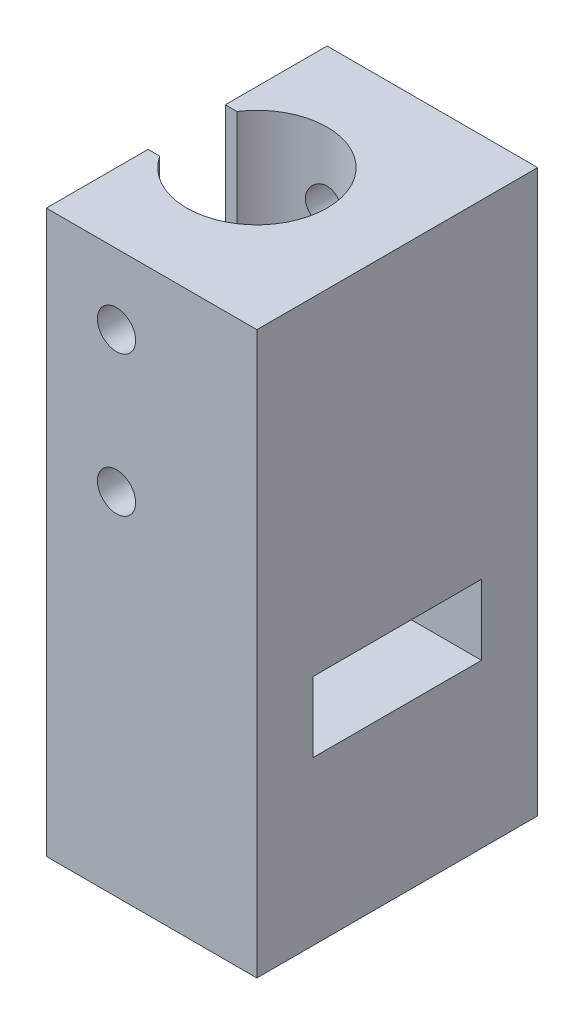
ISO-10303-21;
HEADER;
FILE_DESCRIPTION(('STEP AP214'),'2;1');
FILE_NAME('part.step','',(''),(''),'','','');
FILE_SCHEMA(('AUTOMOTIVE_DESIGN { 1 0 10303 214 1 1 1 1 }'));
ENDSEC;
DATA;
#1=APPLICATION_CONTEXT('core data for automotive mechanical design processes');
#2=APPLICATION_PROTOCOL_DEFINITION('international standard','automotive_design',2000,#1);
#3=PRODUCT_CONTEXT('',#1,'mechanical');
#4=PRODUCT('Part','Part','',(#3));
#5=PRODUCT_RELATED_PRODUCT_CATEGORY('part','',(#4));
#6=PRODUCT_DEFINITION_FORMATION('','',#4);
#7=PRODUCT_DEFINITION_CONTEXT('part definition',#1,'design');
#8=PRODUCT_DEFINITION('design','',#6,#7);
#9=PRODUCT_DEFINITION_SHAPE('','',#8);
#10=(LENGTH_UNIT() NAMED_UNIT(*) SI_UNIT(.MILLI.,.METRE.));
#11=(NAMED_UNIT(*) PLANE_ANGLE_UNIT() SI_UNIT($,.RADIAN.));
#12=(NAMED_UNIT(*) SI_UNIT($,.STERADIAN.) SOLID_ANGLE_UNIT());
#13=UNCERTAINTY_MEASURE_WITH_UNIT(LENGTH_MEASURE(1.E-05),#10,'distance_accuracy_value','');
#14=(GEOMETRIC_REPRESENTATION_CONTEXT(3) GLOBAL_UNCERTAINTY_ASSIGNED_CONTEXT((#13)) GLOBAL_UNIT_ASSIGNED_CONTEXT((#10,
#11,#12)) REPRESENTATION_CONTEXT('',''));
#15=CARTESIAN_POINT('',(0.,0.,0.));
#16=DIRECTION('',(0.,0.,1.));
#17=DIRECTION('',(1.,0.,0.));
#18=AXIS2_PLACEMENT_3D('',#15,#16,#17);
#19=CARTESIAN_POINT('',(-26.6053608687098,6.35,-9.48462085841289));
#20=DIRECTION('',(0.,1.,0.));
#21=DIRECTION('',(0.,0.,1.));
#22=AXIS2_PLACEMENT_3D('',#19,#20,#21);
#23=CYLINDRICAL_SURFACE('',#22,4.44499999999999);
#24=CARTESIAN_POINT('',(-26.6053608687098,14.732,-9.48462085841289));
#25=DIRECTION('',(0.,-1.,0.));
#26=DIRECTION('',(0.,0.,-1.));
#27=AXIS2_PLACEMENT_3D('',#24,#25,#26);
#28=CIRCLE('',#27,4.44499999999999);
#29=CARTESIAN_POINT('',(-26.6053608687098,14.732,-13.9296208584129));
#30=VERTEX_POINT('',#29);
#31=EDGE_CURVE('E237',#30,#30,#28,.F.);
#32=ORIENTED_EDGE('',*,*,#31,.T.);
#33=EDGE_LOOP('',(#32));
#34=FACE_BOUND('',#33,.T.);
#35=DIRECTION('',(0.,1.,0.));
#36=VECTOR('',#35,1.);
#37=CARTESIAN_POINT('',(-26.6053608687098,7.9502,-5.03962085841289));
#38=LINE('',#37,#36);
#39=CARTESIAN_POINT('',(-26.6053608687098,6.35,-5.03962085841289));
#40=VERTEX_POINT('',#39);
#41=CARTESIAN_POINT('',(-26.6053608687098,7.9502,-5.03962085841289));
#42=VERTEX_POINT('',#41);
#43=EDGE_CURVE('E251',#40,#42,#38,.T.);
#44=ORIENTED_EDGE('',*,*,#43,.T.);
#45=CARTESIAN_POINT('',(-26.6053608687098,7.9502,-9.48462085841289));
#46=DIRECTION('',(0.,1.,0.));
#47=DIRECTION('',(0.,0.,1.));
#48=AXIS2_PLACEMENT_3D('',#45,#46,#47);
#49=CIRCLE('',#48,4.44499999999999);
#50=CARTESIAN_POINT('',(-26.6053608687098,7.9502,-13.9296208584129));
#51=VERTEX_POINT('',#50);
#52=EDGE_CURVE('E52',#42,#51,#49,.F.);
#53=ORIENTED_EDGE('',*,*,#52,.T.);
#54=DIRECTION('',(0.,-1.,0.));
#55=VECTOR('',#54,1.);
#56=CARTESIAN_POINT('',(-26.6053608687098,7.9502,-13.9296208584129));
#57=LINE('',#56,#55);
#58=CARTESIAN_POINT('',(-26.6053608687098,6.35,-13.9296208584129));
#59=VERTEX_POINT('',#58);
#60=EDGE_CURVE('E248',#51,#59,#57,.T.);
#61=ORIENTED_EDGE('',*,*,#60,.T.);
#62=CARTESIAN_POINT('',(-26.6053608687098,6.35,-9.48462085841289));
#63=DIRECTION('',(0.,1.,0.));
#64=DIRECTION('',(0.,0.,1.));
#65=AXIS2_PLACEMENT_3D('',#62,#63,#64);
#66=CIRCLE('',#65,4.44499999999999);
#67=EDGE_CURVE('E204',#40,#59,#66,.T.);
#68=ORIENTED_EDGE('',*,*,#67,.F.);
#69=EDGE_LOOP('',(#44,#53,#61,#68));
#70=FACE_BOUND('',#69,.T.);
#71=ADVANCED_FACE('F43',(#34,#70),#23,.F.);
#72=CARTESIAN_POINT('',(-39.3053608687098,50.8,-22.1846208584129));
#73=DIRECTION('',(0.,0.,1.));
#74=DIRECTION('',(1.,0.,0.));
#75=AXIS2_PLACEMENT_3D('',#72,#73,#74);
#76=PLANE('',#75);
#77=CARTESIAN_POINT('',(-26.6053608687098,44.45,-22.1846208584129));
#78=DIRECTION('',(0.,0.,-1.));
#79=DIRECTION('',(-1.,0.,0.));
#80=AXIS2_PLACEMENT_3D('',#77,#78,#79);
#81=CIRCLE('',#80,1.72719999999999);
#82=CARTESIAN_POINT('',(-28.3325608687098,44.45,-22.1846208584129));
#83=VERTEX_POINT('',#82);
#84=EDGE_CURVE('E435',#83,#83,#81,.T.);
#85=ORIENTED_EDGE('',*,*,#84,.F.);
#86=EDGE_LOOP('',(#85));
#87=FACE_BOUND('',#86,.T.);
#88=DIRECTION('',(-1.,0.,0.));
#89=VECTOR('',#88,1.);
#90=CARTESIAN_POINT('',(-39.3053608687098,0.,-22.1846208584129));
#91=LINE('',#90,#89);
#92=CARTESIAN_POINT('',(-13.9053608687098,0.,-22.1846208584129));
#93=VERTEX_POINT('',#92);
#94=CARTESIAN_POINT('',(-32.9553608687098,0.,-22.1846208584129));
#95=VERTEX_POINT('',#94);
#96=EDGE_CURVE('E194',#93,#95,#91,.T.);
#97=ORIENTED_EDGE('',*,*,#96,.T.);
#98=DIRECTION('',(0.,-1.,0.));
#99=VECTOR('',#98,1.);
#100=CARTESIAN_POINT('',(-32.9553608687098,50.8,-22.1846208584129));
#101=LINE('',#100,#99);
#102=CARTESIAN_POINT('',(-32.9553608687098,50.8,-22.1846208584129));
#103=VERTEX_POINT('',#102);
#104=EDGE_CURVE('E177',#103,#95,#101,.T.);
#105=ORIENTED_EDGE('',*,*,#104,.F.);
#106=DIRECTION('',(-1.,0.,0.));
#107=VECTOR('',#106,1.);
#108=CARTESIAN_POINT('',(-39.3053608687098,50.8,-22.1846208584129));
#109=LINE('',#108,#107);
#110=CARTESIAN_POINT('',(-13.9053608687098,50.8,-22.1846208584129));
#111=VERTEX_POINT('',#110);
#112=EDGE_CURVE('E198',#111,#103,#109,.T.);
#113=ORIENTED_EDGE('',*,*,#112,.F.);
#114=DIRECTION('',(0.,-1.,0.));
#115=VECTOR('',#114,1.);
#116=CARTESIAN_POINT('',(-13.9053608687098,50.8,-22.1846208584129));
#117=LINE('',#116,#115);
#118=EDGE_CURVE('E210',#111,#93,#117,.T.);
#119=ORIENTED_EDGE('',*,*,#118,.T.);
#120=EDGE_LOOP('',(#97,#105,#113,#119));
#121=FACE_BOUND('',#120,.T.);
#122=CARTESIAN_POINT('',(-26.6053608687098,31.75,-22.1846208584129));
#123=DIRECTION('',(0.,0.,-1.));
#124=DIRECTION('',(-1.,0.,0.));
#125=AXIS2_PLACEMENT_3D('',#122,#123,#124);
#126=CIRCLE('',#125,1.72719999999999);
#127=CARTESIAN_POINT('',(-28.3325608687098,31.75,-22.1846208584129));
#128=VERTEX_POINT('',#127);
#129=EDGE_CURVE('E413',#128,#128,#126,.T.);
#130=ORIENTED_EDGE('',*,*,#129,.F.);
#131=EDGE_LOOP('',(#130));
#132=FACE_BOUND('',#131,.T.);
#133=ADVANCED_FACE('F304',(#87,#121,#132),#76,.F.);
#134=DIRECTION('',(0.,1.,0.));
#135=VECTOR('',#134,1.);
#136=CARTESIAN_POINT('',(-29.3549915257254,6.35,-12.9771208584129));
#137=LINE('',#136,#135);
#138=CARTESIAN_POINT('',(-29.3549915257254,25.4,-12.9771208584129));
#139=VERTEX_POINT('',#138);
#140=CARTESIAN_POINT('',(-29.3549915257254,21.082,-12.9771208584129));
#141=VERTEX_POINT('',#140);
#142=EDGE_CURVE('E229',#139,#141,#137,.F.);
#143=ORIENTED_EDGE('',*,*,#142,.T.);
#144=CARTESIAN_POINT('',(-26.6053608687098,21.082,-9.48462085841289));
#145=DIRECTION('',(0.,1.,0.));
#146=DIRECTION('',(0.,0.,1.));
#147=AXIS2_PLACEMENT_3D('',#144,#145,#146);
#148=CIRCLE('',#147,4.44499999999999);
#149=CARTESIAN_POINT('',(-29.3549915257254,21.082,-5.99212085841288));
#150=VERTEX_POINT('',#149);
#151=EDGE_CURVE('E325',#141,#150,#148,.F.);
#152=ORIENTED_EDGE('',*,*,#151,.T.);
#153=DIRECTION('',(0.,1.,0.));
#154=VECTOR('',#153,1.);
#155=CARTESIAN_POINT('',(-29.3549915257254,6.35,-5.99212085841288));
#156=LINE('',#155,#154);
#157=CARTESIAN_POINT('',(-29.3549915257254,25.4,-5.99212085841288));
#158=VERTEX_POINT('',#157);
#159=EDGE_CURVE('E221',#150,#158,#156,.T.);
#160=ORIENTED_EDGE('',*,*,#159,.T.);
#161=CARTESIAN_POINT('',(-26.6053608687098,25.4,-9.48462085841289));
#162=DIRECTION('',(0.,1.,0.));
#163=DIRECTION('',(0.,0.,1.));
#164=AXIS2_PLACEMENT_3D('',#161,#162,#163);
#165=CIRCLE('',#164,4.44499999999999);
#166=EDGE_CURVE('E222',#139,#158,#165,.F.);
#167=ORIENTED_EDGE('',*,*,#166,.F.);
#168=EDGE_LOOP('',(#143,#152,#160,#167));
#169=FACE_BOUND('',#168,.T.);
#170=ADVANCED_FACE('F307',(#169),#23,.F.);
#171=CARTESIAN_POINT('',(-39.3053608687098,50.8,3.21537914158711));
#172=DIRECTION('',(0.,0.,-1.));
#173=DIRECTION('',(-1.,0.,0.));
#174=AXIS2_PLACEMENT_3D('',#171,#172,#173);
#175=PLANE('',#174);
#176=CARTESIAN_POINT('',(-26.6053608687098,44.45,3.21537914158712));
#177=DIRECTION('',(0.,0.,1.));
#178=DIRECTION('',(1.,0.,0.));
#179=AXIS2_PLACEMENT_3D('',#176,#177,#178);
#180=CIRCLE('',#179,1.72719999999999);
#181=CARTESIAN_POINT('',(-24.8781608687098,44.45,3.21537914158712));
#182=VERTEX_POINT('',#181);
#183=EDGE_CURVE('E267',#182,#182,#180,.T.);
#184=ORIENTED_EDGE('',*,*,#183,.F.);
#185=EDGE_LOOP('',(#184));
#186=FACE_BOUND('',#185,.T.);
#187=CARTESIAN_POINT('',(-26.6053608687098,31.75,3.21537914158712));
#188=DIRECTION('',(0.,0.,1.));
#189=DIRECTION('',(1.,0.,0.));
#190=AXIS2_PLACEMENT_3D('',#187,#188,#189);
#191=CIRCLE('',#190,1.72719999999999);
#192=CARTESIAN_POINT('',(-24.8781608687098,31.75,3.21537914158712));
#193=VERTEX_POINT('',#192);
#194=EDGE_CURVE('E285',#193,#193,#191,.T.);
#195=ORIENTED_EDGE('',*,*,#194,.F.);
#196=EDGE_LOOP('',(#195));
#197=FACE_BOUND('',#196,.T.);
#198=DIRECTION('',(1.,0.,0.));
#199=VECTOR('',#198,1.);
#200=CARTESIAN_POINT('',(-39.3053608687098,50.8,3.21537914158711));
#201=LINE('',#200,#199);
#202=CARTESIAN_POINT('',(-32.9553608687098,50.8,3.21537914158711));
#203=VERTEX_POINT('',#202);
#204=CARTESIAN_POINT('',(-13.9053608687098,50.8,3.21537914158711));
#205=VERTEX_POINT('',#204);
#206=EDGE_CURVE('E182',#203,#205,#201,.T.);
#207=ORIENTED_EDGE('',*,*,#206,.F.);
#208=DIRECTION('',(0.,-1.,0.));
#209=VECTOR('',#208,1.);
#210=CARTESIAN_POINT('',(-32.9553608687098,50.8,3.21537914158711));
#211=LINE('',#210,#209);
#212=CARTESIAN_POINT('',(-32.9553608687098,0.,3.21537914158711));
#213=VERTEX_POINT('',#212);
#214=EDGE_CURVE('E166',#203,#213,#211,.T.);
#215=ORIENTED_EDGE('',*,*,#214,.T.);
#216=DIRECTION('',(1.,0.,0.));
#217=VECTOR('',#216,1.);
#218=CARTESIAN_POINT('',(-39.3053608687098,0.,3.21537914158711));
#219=LINE('',#218,#217);
#220=CARTESIAN_POINT('',(-13.9053608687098,0.,3.21537914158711));
#221=VERTEX_POINT('',#220);
#222=EDGE_CURVE('E211',#213,#221,#219,.T.);
#223=ORIENTED_EDGE('',*,*,#222,.T.);
#224=DIRECTION('',(0.,-1.,0.));
#225=VECTOR('',#224,1.);
#226=CARTESIAN_POINT('',(-13.9053608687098,50.8,3.21537914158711));
#227=LINE('',#226,#225);
#228=EDGE_CURVE('E190',#205,#221,#227,.T.);
#229=ORIENTED_EDGE('',*,*,#228,.F.);
#230=EDGE_LOOP('',(#207,#215,#223,#229));
#231=FACE_BOUND('',#230,.T.);
#232=ADVANCED_FACE('F45',(#186,#197,#231),#175,.F.);
#233=CARTESIAN_POINT('',(-13.9053608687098,50.8,-22.1846208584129));
#234=DIRECTION('',(-1.,0.,0.));
#235=DIRECTION('',(0.,0.,1.));
#236=AXIS2_PLACEMENT_3D('',#233,#234,#235);
#237=PLANE('',#236);
#238=DIRECTION('',(0.,0.,-1.));
#239=VECTOR('',#238,1.);
#240=CARTESIAN_POINT('',(-13.9053608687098,21.082,-17.1046208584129));
#241=LINE('',#240,#239);
#242=CARTESIAN_POINT('',(-13.9053608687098,21.082,-1.86462085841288));
#243=VERTEX_POINT('',#242);
#244=CARTESIAN_POINT('',(-13.9053608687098,21.082,-17.1046208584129));
#245=VERTEX_POINT('',#244);
#246=EDGE_CURVE('E378',#243,#245,#241,.T.);
#247=ORIENTED_EDGE('',*,*,#246,.T.);
#248=DIRECTION('',(0.,-1.,0.));
#249=VECTOR('',#248,1.);
#250=CARTESIAN_POINT('',(-13.9053608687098,21.082,-17.1046208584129));
#251=LINE('',#250,#249);
#252=CARTESIAN_POINT('',(-13.9053608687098,14.732,-17.1046208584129));
#253=VERTEX_POINT('',#252);
#254=EDGE_CURVE('E400',#245,#253,#251,.T.);
#255=ORIENTED_EDGE('',*,*,#254,.T.);
#256=DIRECTION('',(0.,0.,1.));
#257=VECTOR('',#256,1.);
#258=CARTESIAN_POINT('',(-13.9053608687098,14.732,-17.1046208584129));
#259=LINE('',#258,#257);
#260=CARTESIAN_POINT('',(-13.9053608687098,14.732,-1.86462085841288));
#261=VERTEX_POINT('',#260);
#262=EDGE_CURVE('E396',#253,#261,#259,.T.);
#263=ORIENTED_EDGE('',*,*,#262,.T.);
#264=DIRECTION('',(0.,1.,0.));
#265=VECTOR('',#264,1.);
#266=CARTESIAN_POINT('',(-13.9053608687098,21.082,-1.86462085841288));
#267=LINE('',#266,#265);
#268=EDGE_CURVE('E392',#261,#243,#267,.T.);
#269=ORIENTED_EDGE('',*,*,#268,.T.);
#270=EDGE_LOOP('',(#247,#255,#263,#269));
#271=FACE_BOUND('',#270,.T.);
#272=DIRECTION('',(0.,0.,-1.));
#273=VECTOR('',#272,1.);
#274=CARTESIAN_POINT('',(-13.9053608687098,0.,-22.1846208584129));
#275=LINE('',#274,#273);
#276=EDGE_CURVE('E201',#221,#93,#275,.T.);
#277=ORIENTED_EDGE('',*,*,#276,.T.);
#278=ORIENTED_EDGE('',*,*,#118,.F.);
#279=DIRECTION('',(0.,0.,-1.));
#280=VECTOR('',#279,1.);
#281=CARTESIAN_POINT('',(-13.9053608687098,50.8,-22.1846208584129));
#282=LINE('',#281,#280);
#283=EDGE_CURVE('E193',#205,#111,#282,.T.);
#284=ORIENTED_EDGE('',*,*,#283,.F.);
#285=ORIENTED_EDGE('',*,*,#228,.T.);
#286=EDGE_LOOP('',(#277,#278,#284,#285));
#287=FACE_BOUND('',#286,.T.);
#288=ADVANCED_FACE('F320',(#271,#287),#237,.F.);
#289=CARTESIAN_POINT('',(0.,50.8,0.));
#290=DIRECTION('',(0.,1.,0.));
#291=DIRECTION('',(0.,0.,1.));
#292=AXIS2_PLACEMENT_3D('',#289,#290,#291);
#293=PLANE('',#292);
#294=DIRECTION('',(0.,0.,1.));
#295=VECTOR('',#294,1.);
#296=CARTESIAN_POINT('',(-32.9553608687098,50.8,-22.1846208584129));
#297=LINE('',#296,#295);
#298=CARTESIAN_POINT('',(-32.9553608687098,50.8,-5.99212085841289));
#299=VERTEX_POINT('',#298);
#300=EDGE_CURVE('E169',#299,#203,#297,.T.);
#301=ORIENTED_EDGE('',*,*,#300,.T.);
#302=ORIENTED_EDGE('',*,*,#206,.T.);
#303=ORIENTED_EDGE('',*,*,#283,.T.);
#304=ORIENTED_EDGE('',*,*,#112,.T.);
#305=CARTESIAN_POINT('',(-32.9553608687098,50.8,-12.9771208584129));
#306=VERTEX_POINT('',#305);
#307=EDGE_CURVE('E187',#103,#306,#297,.T.);
#308=ORIENTED_EDGE('',*,*,#307,.T.);
#309=DIRECTION('',(-1.,0.,0.));
#310=VECTOR('',#309,1.);
#311=CARTESIAN_POINT('',(-26.6053608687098,50.8,-12.9771208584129));
#312=LINE('',#311,#310);
#313=CARTESIAN_POINT('',(-31.9086564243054,50.8,-12.9771208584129));
#314=VERTEX_POINT('',#313);
#315=EDGE_CURVE('E360',#314,#306,#312,.T.);
#316=ORIENTED_EDGE('',*,*,#315,.F.);
#317=CARTESIAN_POINT('',(-26.6053608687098,50.8,-9.48462085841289));
#318=DIRECTION('',(0.,1.,0.));
#319=DIRECTION('',(0.,0.,1.));
#320=AXIS2_PLACEMENT_3D('',#317,#318,#319);
#321=CIRCLE('',#320,6.35);
#322=CARTESIAN_POINT('',(-31.9086564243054,50.8,-5.99212085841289));
#323=VERTEX_POINT('',#322);
#324=EDGE_CURVE('E346',#323,#314,#321,.T.);
#325=ORIENTED_EDGE('',*,*,#324,.F.);
#326=DIRECTION('',(-1.,0.,0.));
#327=VECTOR('',#326,1.);
#328=CARTESIAN_POINT('',(-26.6053608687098,50.8,-5.99212085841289));
#329=LINE('',#328,#327);
#330=EDGE_CURVE('E185',#323,#299,#329,.T.);
#331=ORIENTED_EDGE('',*,*,#330,.T.);
#332=EDGE_LOOP('',(#301,#302,#303,#304,#308,#316,#325,#331));
#333=FACE_BOUND('',#332,.T.);
#334=ADVANCED_FACE('F181',(#333),#293,.T.);
#335=CARTESIAN_POINT('',(0.,0.,0.));
#336=DIRECTION('',(0.,1.,0.));
#337=DIRECTION('',(0.,0.,1.));
#338=AXIS2_PLACEMENT_3D('',#335,#336,#337);
#339=PLANE('',#338);
#340=ORIENTED_EDGE('',*,*,#222,.F.);
#341=DIRECTION('',(0.,0.,1.));
#342=VECTOR('',#341,1.);
#343=CARTESIAN_POINT('',(-32.9553608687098,0.,-22.1846208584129));
#344=LINE('',#343,#342);
#345=EDGE_CURVE('E172',#95,#213,#344,.T.);
#346=ORIENTED_EDGE('',*,*,#345,.F.);
#347=ORIENTED_EDGE('',*,*,#96,.F.);
#348=ORIENTED_EDGE('',*,*,#276,.F.);
#349=EDGE_LOOP('',(#340,#346,#347,#348));
#350=FACE_BOUND('',#349,.T.);
#351=ADVANCED_FACE('F488',(#350),#339,.F.);
#352=CARTESIAN_POINT('',(-26.6053608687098,25.4,-9.48462085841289));
#353=DIRECTION('',(0.,1.,0.));
#354=DIRECTION('',(0.,0.,1.));
#355=AXIS2_PLACEMENT_3D('',#352,#353,#354);
#356=PLANE('',#355);
#357=DIRECTION('',(-1.,0.,0.));
#358=VECTOR('',#357,1.);
#359=CARTESIAN_POINT('',(-26.6053608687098,25.4,-12.9771208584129));
#360=LINE('',#359,#358);
#361=CARTESIAN_POINT('',(-31.9086564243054,25.4,-12.9771208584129));
#362=VERTEX_POINT('',#361);
#363=EDGE_CURVE('E331',#139,#362,#360,.T.);
#364=ORIENTED_EDGE('',*,*,#363,.F.);
#365=ORIENTED_EDGE('',*,*,#166,.T.);
#366=DIRECTION('',(1.,0.,0.));
#367=VECTOR('',#366,1.);
#368=CARTESIAN_POINT('',(-26.6053608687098,25.4,-5.99212085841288));
#369=LINE('',#368,#367);
#370=CARTESIAN_POINT('',(-31.9086564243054,25.4,-5.99212085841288));
#371=VERTEX_POINT('',#370);
#372=EDGE_CURVE('E349',#371,#158,#369,.T.);
#373=ORIENTED_EDGE('',*,*,#372,.F.);
#374=CARTESIAN_POINT('',(-26.6053608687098,25.4,-9.48462085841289));
#375=DIRECTION('',(0.,1.,0.));
#376=DIRECTION('',(0.,0.,1.));
#377=AXIS2_PLACEMENT_3D('',#374,#375,#376);
#378=CIRCLE('',#377,6.35);
#379=EDGE_CURVE('E226',#371,#362,#378,.T.);
#380=ORIENTED_EDGE('',*,*,#379,.T.);
#381=EDGE_LOOP('',(#364,#365,#373,#380));
#382=FACE_BOUND('',#381,.T.);
#383=ADVANCED_FACE('F337',(#382),#356,.T.);
#384=CARTESIAN_POINT('',(-26.6053608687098,25.4,-9.48462085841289));
#385=DIRECTION('',(0.,1.,0.));
#386=DIRECTION('',(0.,0.,1.));
#387=AXIS2_PLACEMENT_3D('',#384,#385,#386);
#388=CYLINDRICAL_SURFACE('',#387,6.35);
#389=CARTESIAN_POINT('',(-24.8781608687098,44.45,-3.37403331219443));
#390=CARTESIAN_POINT('',(-24.8781630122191,44.3549284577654,-3.3740317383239));
#391=CARTESIAN_POINT('',(-24.8860372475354,44.2598345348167,-3.37179029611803));
#392=CARTESIAN_POINT('',(-24.9172632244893,44.0723981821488,-3.36309486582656));
#393=CARTESIAN_POINT('',(-24.9406223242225,43.9800570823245,-3.35663887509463));
#394=CARTESIAN_POINT('',(-25.0019892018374,43.8008651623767,-3.34029842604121));
#395=CARTESIAN_POINT('',(-25.0399758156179,43.7140066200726,-3.3304189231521));
#396=CARTESIAN_POINT('',(-25.1294525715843,43.5478804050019,-3.30835099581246));
#397=CARTESIAN_POINT('',(-25.1809439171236,43.4686134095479,-3.29616236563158));
#398=CARTESIAN_POINT('',(-25.2974014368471,43.3178578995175,-3.27049410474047));
#399=CARTESIAN_POINT('',(-25.3626560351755,43.246596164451,-3.25699085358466));
#400=CARTESIAN_POINT('',(-25.5041677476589,43.1158810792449,-3.23041837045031));
#401=CARTESIAN_POINT('',(-25.5804260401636,43.0564289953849,-3.21734918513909));
#402=CARTESIAN_POINT('',(-25.7433591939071,42.9500692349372,-3.19285307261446));
#403=CARTESIAN_POINT('',(-25.8301868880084,42.9033878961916,-3.18145725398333));
#404=CARTESIAN_POINT('',(-26.0108204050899,42.8253723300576,-3.16186341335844));
#405=CARTESIAN_POINT('',(-26.1046249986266,42.7940354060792,-3.15366482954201));
#406=CARTESIAN_POINT('',(-26.2941815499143,42.7483346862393,-3.14155625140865));
#407=CARTESIAN_POINT('',(-26.3898341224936,42.7335849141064,-3.13754889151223));
#408=CARTESIAN_POINT('',(-26.5823344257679,42.7202619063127,-3.13393348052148));
#409=CARTESIAN_POINT('',(-26.6791819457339,42.7216858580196,-3.13432466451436));
#410=CARTESIAN_POINT('',(-26.8686332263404,42.7404000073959,-3.13939130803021));
#411=CARTESIAN_POINT('',(-26.961281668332,42.7572730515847,-3.14395412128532));
#412=CARTESIAN_POINT('',(-27.1423789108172,42.8057313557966,-3.15671781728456));
#413=CARTESIAN_POINT('',(-27.2308274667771,42.837317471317,-3.16491891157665));
#414=CARTESIAN_POINT('',(-27.4020678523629,42.914619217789,-3.18420302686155));
#415=CARTESIAN_POINT('',(-27.4847926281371,42.9604759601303,-3.19531464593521));
#416=CARTESIAN_POINT('',(-27.6415138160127,43.0649084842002,-3.2192253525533));
#417=CARTESIAN_POINT('',(-27.7155084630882,43.1234868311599,-3.23202478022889));
#418=CARTESIAN_POINT('',(-27.8551591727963,43.2539066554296,-3.25840846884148));
#419=CARTESIAN_POINT('',(-27.9204738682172,43.3261116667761,-3.2720047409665));
#420=CARTESIAN_POINT('',(-28.0381527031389,43.4805898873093,-3.29808301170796));
#421=CARTESIAN_POINT('',(-28.0905159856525,43.5628637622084,-3.31056493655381));
#422=CARTESIAN_POINT('',(-28.1810796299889,43.7359083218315,-3.3330509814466));
#423=CARTESIAN_POINT('',(-28.2191836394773,43.8267317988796,-3.34303809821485));
#424=CARTESIAN_POINT('',(-28.2794679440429,44.0138359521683,-3.35919431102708));
#425=CARTESIAN_POINT('',(-28.3016523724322,44.110115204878,-3.36536439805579));
#426=CARTESIAN_POINT('',(-28.3288718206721,44.3021965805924,-3.37297582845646));
#427=CARTESIAN_POINT('',(-28.3344175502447,44.3979208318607,-3.3745579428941));
#428=CARTESIAN_POINT('',(-28.3296122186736,44.5889296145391,-3.37320008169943));
#429=CARTESIAN_POINT('',(-28.3192629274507,44.6842141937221,-3.37026060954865));
#430=CARTESIAN_POINT('',(-28.2834123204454,44.869646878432,-3.36032710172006));
#431=CARTESIAN_POINT('',(-28.2582212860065,44.9598598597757,-3.35341616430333));
#432=CARTESIAN_POINT('',(-28.1937527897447,45.1347792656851,-3.33640035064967));
#433=CARTESIAN_POINT('',(-28.1544734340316,45.2194849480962,-3.32629504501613));
#434=CARTESIAN_POINT('',(-28.0619170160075,45.3831129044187,-3.30374263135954));
#435=CARTESIAN_POINT('',(-28.0083418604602,45.4618597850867,-3.29124748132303));
#436=CARTESIAN_POINT('',(-27.8890817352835,45.6094330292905,-3.26543474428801));
#437=CARTESIAN_POINT('',(-27.8233943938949,45.6782574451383,-3.25211699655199));
#438=CARTESIAN_POINT('',(-27.6794062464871,45.8061693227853,-3.22567250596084));
#439=CARTESIAN_POINT('',(-27.6007842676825,45.8648997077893,-3.21256369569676));
#440=CARTESIAN_POINT('',(-27.4345025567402,45.9683308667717,-3.18842586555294));
#441=CARTESIAN_POINT('',(-27.3468433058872,46.0130323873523,-3.17739673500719));
#442=CARTESIAN_POINT('',(-27.1655921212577,46.0867209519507,-3.15873206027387));
#443=CARTESIAN_POINT('',(-27.0720509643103,46.1158261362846,-3.15107108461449));
#444=CARTESIAN_POINT('',(-26.8811648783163,46.1578338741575,-3.13989383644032));
#445=CARTESIAN_POINT('',(-26.7838208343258,46.1707401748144,-3.13637660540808));
#446=CARTESIAN_POINT('',(-26.5914223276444,46.1797411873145,-3.13393042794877));
#447=CARTESIAN_POINT('',(-26.4963937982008,46.1763586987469,-3.13485879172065));
#448=CARTESIAN_POINT('',(-26.3083112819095,46.1540975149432,-3.14087472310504));
#449=CARTESIAN_POINT('',(-26.2152572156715,46.1352194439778,-3.14596212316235));
#450=CARTESIAN_POINT('',(-26.0344208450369,46.0828032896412,-3.15969418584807));
#451=CARTESIAN_POINT('',(-25.946604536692,46.0493750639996,-3.16831216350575));
#452=CARTESIAN_POINT('',(-25.7777772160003,45.9689053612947,-3.18820607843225));
#453=CARTESIAN_POINT('',(-25.6967671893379,45.9218619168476,-3.19948239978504));
#454=CARTESIAN_POINT('',(-25.5414335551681,45.813988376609,-3.22387689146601));
#455=CARTESIAN_POINT('',(-25.4673553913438,45.7528144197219,-3.23703721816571));
#456=CARTESIAN_POINT('',(-25.3303393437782,45.6190634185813,-3.26355177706));
#457=CARTESIAN_POINT('',(-25.2674044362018,45.5464833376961,-3.27690606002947));
#458=CARTESIAN_POINT('',(-25.1530161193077,45.3899605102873,-3.30265359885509));
#459=CARTESIAN_POINT('',(-25.1018620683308,45.3057937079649,-3.31501746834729));
#460=CARTESIAN_POINT('',(-25.0145016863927,45.1297283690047,-3.33696202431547));
#461=CARTESIAN_POINT('',(-24.9782859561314,45.0378347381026,-3.34654445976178));
#462=CARTESIAN_POINT('',(-24.926350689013,44.8636202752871,-3.36056762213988));
#463=CARTESIAN_POINT('',(-24.9083229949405,44.7820261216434,-3.36557540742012));
#464=CARTESIAN_POINT('',(-24.884227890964,44.6169602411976,-3.37230873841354));
#465=CARTESIAN_POINT('',(-24.8781589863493,44.5334887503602,-3.37403469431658));
#466=CARTESIAN_POINT('',(-24.8781608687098,44.45,-3.37403331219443));
#467=B_SPLINE_CURVE_WITH_KNOTS('',3,(#389,#390,#391,#392,#393,#394,#395,#396,#397,#398,#399,
#400,#401,#402,#403,#404,#405,#406,#407,#408,#409,#410,#411,#412,#413,#414,#415,#416,#417,#418,
#419,#420,#421,#422,#423,#424,#425,#426,#427,#428,#429,#430,#431,#432,#433,#434,#435,#436,#437,
#438,#439,#440,#441,#442,#443,#444,#445,#446,#447,#448,#449,#450,#451,#452,#453,#454,#455,#456,
#457,#458,#459,#460,#461,#462,#463,#464,#465,#466),.UNSPECIFIED.,.T.,.F.,(4,2,2,2,2,2,2,2,2,2,2,
2,2,2,2,2,2,2,2,2,2,2,2,2,2,2,2,2,2,2,2,2,2,2,2,2,2,2,4),(0.,0.284907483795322,
0.569950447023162,0.854582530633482,1.13923998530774,1.4305920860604,1.72197540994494,
2.01823016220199,2.31443283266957,2.60359035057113,2.89269758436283,3.17422149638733,
3.45576177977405,3.74017954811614,4.02465472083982,4.31820614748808,4.6117769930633,
4.90729718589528,5.20274062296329,5.48901787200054,5.77526324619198,6.05572669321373,
6.33622785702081,6.62310984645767,6.91004807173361,7.20565699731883,7.50125018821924,
7.79457145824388,8.08782486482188,8.37173002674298,8.65562375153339,8.93741020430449,
9.21923739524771,9.50882250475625,9.79848484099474,10.0948495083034,10.3910274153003,
10.641255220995,10.8914517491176),.UNSPECIFIED.);
#468=CARTESIAN_POINT('',(-24.8781608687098,44.45,-3.37403331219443));
#469=VERTEX_POINT('',#468);
#470=EDGE_CURVE('E276',#469,#469,#467,.T.);
#471=ORIENTED_EDGE('',*,*,#470,.F.);
#472=EDGE_LOOP('',(#471));
#473=FACE_BOUND('',#472,.T.);
#474=CARTESIAN_POINT('',(-24.8781608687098,31.75,-3.37403331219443));
#475=CARTESIAN_POINT('',(-24.8781630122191,31.6549284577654,-3.3740317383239));
#476=CARTESIAN_POINT('',(-24.8860372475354,31.5598345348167,-3.37179029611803));
#477=CARTESIAN_POINT('',(-24.9172632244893,31.3723981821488,-3.36309486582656));
#478=CARTESIAN_POINT('',(-24.9406223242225,31.2800570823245,-3.35663887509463));
#479=CARTESIAN_POINT('',(-25.0019892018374,31.1008651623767,-3.34029842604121));
#480=CARTESIAN_POINT('',(-25.0399758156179,31.0140066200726,-3.3304189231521));
#481=CARTESIAN_POINT('',(-25.1294525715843,30.8478804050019,-3.30835099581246));
#482=CARTESIAN_POINT('',(-25.1809439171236,30.7686134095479,-3.29616236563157));
#483=CARTESIAN_POINT('',(-25.2974014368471,30.6178578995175,-3.27049410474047));
#484=CARTESIAN_POINT('',(-25.3626560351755,30.546596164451,-3.25699085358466));
#485=CARTESIAN_POINT('',(-25.5041677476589,30.4158810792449,-3.23041837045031));
#486=CARTESIAN_POINT('',(-25.5804260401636,30.3564289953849,-3.21734918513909));
#487=CARTESIAN_POINT('',(-25.7433591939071,30.2500692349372,-3.19285307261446));
#488=CARTESIAN_POINT('',(-25.8301868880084,30.2033878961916,-3.18145725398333));
#489=CARTESIAN_POINT('',(-26.0108204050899,30.1253723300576,-3.16186341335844));
#490=CARTESIAN_POINT('',(-26.1046249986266,30.0940354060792,-3.15366482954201));
#491=CARTESIAN_POINT('',(-26.2941815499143,30.0483346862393,-3.14155625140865));
#492=CARTESIAN_POINT('',(-26.3898341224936,30.0335849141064,-3.13754889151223));
#493=CARTESIAN_POINT('',(-26.582334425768,30.0202619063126,-3.13393348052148));
#494=CARTESIAN_POINT('',(-26.6791819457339,30.0216858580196,-3.13432466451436));
#495=CARTESIAN_POINT('',(-26.8686332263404,30.0404000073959,-3.13939130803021));
#496=CARTESIAN_POINT('',(-26.961281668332,30.0572730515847,-3.14395412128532));
#497=CARTESIAN_POINT('',(-27.1423789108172,30.1057313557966,-3.15671781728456));
#498=CARTESIAN_POINT('',(-27.2308274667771,30.137317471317,-3.16491891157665));
#499=CARTESIAN_POINT('',(-27.4020678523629,30.214619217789,-3.18420302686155));
#500=CARTESIAN_POINT('',(-27.4847926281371,30.2604759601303,-3.19531464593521));
#501=CARTESIAN_POINT('',(-27.6415138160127,30.3649084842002,-3.2192253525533));
#502=CARTESIAN_POINT('',(-27.7155084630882,30.4234868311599,-3.23202478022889));
#503=CARTESIAN_POINT('',(-27.8551591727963,30.5539066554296,-3.25840846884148));
#504=CARTESIAN_POINT('',(-27.9204738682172,30.6261116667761,-3.2720047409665));
#505=CARTESIAN_POINT('',(-28.0381527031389,30.7805898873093,-3.29808301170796));
#506=CARTESIAN_POINT('',(-28.0905159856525,30.8628637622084,-3.31056493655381));
#507=CARTESIAN_POINT('',(-28.1810796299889,31.0359083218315,-3.3330509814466));
#508=CARTESIAN_POINT('',(-28.2191836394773,31.1267317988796,-3.34303809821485));
#509=CARTESIAN_POINT('',(-28.2794679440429,31.3138359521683,-3.35919431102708));
#510=CARTESIAN_POINT('',(-28.3016523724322,31.410115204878,-3.36536439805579));
#511=CARTESIAN_POINT('',(-28.3288718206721,31.6021965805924,-3.37297582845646));
#512=CARTESIAN_POINT('',(-28.3344175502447,31.6979208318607,-3.3745579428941));
#513=CARTESIAN_POINT('',(-28.3296122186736,31.8889296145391,-3.37320008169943));
#514=CARTESIAN_POINT('',(-28.3192629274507,31.9842141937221,-3.37026060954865));
#515=CARTESIAN_POINT('',(-28.2834123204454,32.169646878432,-3.36032710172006));
#516=CARTESIAN_POINT('',(-28.2582212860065,32.2598598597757,-3.35341616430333));
#517=CARTESIAN_POINT('',(-28.1937527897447,32.4347792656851,-3.33640035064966));
#518=CARTESIAN_POINT('',(-28.1544734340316,32.5194849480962,-3.32629504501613));
#519=CARTESIAN_POINT('',(-28.0619170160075,32.6831129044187,-3.30374263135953));
#520=CARTESIAN_POINT('',(-28.0083418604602,32.7618597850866,-3.29124748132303));
#521=CARTESIAN_POINT('',(-27.8890817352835,32.9094330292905,-3.265434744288));
#522=CARTESIAN_POINT('',(-27.8233943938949,32.9782574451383,-3.25211699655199));
#523=CARTESIAN_POINT('',(-27.6794062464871,33.1061693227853,-3.22567250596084));
#524=CARTESIAN_POINT('',(-27.6007842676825,33.1648997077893,-3.21256369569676));
#525=CARTESIAN_POINT('',(-27.4345025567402,33.2683308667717,-3.18842586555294));
#526=CARTESIAN_POINT('',(-27.3468433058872,33.3130323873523,-3.17739673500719));
#527=CARTESIAN_POINT('',(-27.1655921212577,33.3867209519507,-3.15873206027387));
#528=CARTESIAN_POINT('',(-27.0720509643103,33.4158261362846,-3.15107108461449));
#529=CARTESIAN_POINT('',(-26.8811648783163,33.4578338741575,-3.13989383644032));
#530=CARTESIAN_POINT('',(-26.7838208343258,33.4707401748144,-3.13637660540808));
#531=CARTESIAN_POINT('',(-26.5914223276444,33.4797411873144,-3.13393042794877));
#532=CARTESIAN_POINT('',(-26.4963937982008,33.4763586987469,-3.13485879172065));
#533=CARTESIAN_POINT('',(-26.3083112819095,33.4540975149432,-3.14087472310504));
#534=CARTESIAN_POINT('',(-26.2152572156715,33.4352194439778,-3.14596212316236));
#535=CARTESIAN_POINT('',(-26.0344208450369,33.3828032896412,-3.15969418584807));
#536=CARTESIAN_POINT('',(-25.946604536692,33.3493750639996,-3.16831216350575));
#537=CARTESIAN_POINT('',(-25.7777772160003,33.2689053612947,-3.18820607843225));
#538=CARTESIAN_POINT('',(-25.6967671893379,33.2218619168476,-3.19948239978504));
#539=CARTESIAN_POINT('',(-25.5414335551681,33.113988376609,-3.22387689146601));
#540=CARTESIAN_POINT('',(-25.4673553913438,33.0528144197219,-3.23703721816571));
#541=CARTESIAN_POINT('',(-25.3303393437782,32.9190634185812,-3.26355177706));
#542=CARTESIAN_POINT('',(-25.2674044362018,32.846483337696,-3.27690606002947));
#543=CARTESIAN_POINT('',(-25.1530161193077,32.6899605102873,-3.30265359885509));
#544=CARTESIAN_POINT('',(-25.1018620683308,32.6057937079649,-3.31501746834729));
#545=CARTESIAN_POINT('',(-25.0145016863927,32.4297283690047,-3.33696202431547));
#546=CARTESIAN_POINT('',(-24.9782859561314,32.3378347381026,-3.34654445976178));
#547=CARTESIAN_POINT('',(-24.926350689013,32.1636202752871,-3.36056762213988));
#548=CARTESIAN_POINT('',(-24.9083229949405,32.0820261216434,-3.36557540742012));
#549=CARTESIAN_POINT('',(-24.884227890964,31.9169602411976,-3.37230873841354));
#550=CARTESIAN_POINT('',(-24.8781589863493,31.8334887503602,-3.37403469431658));
#551=CARTESIAN_POINT('',(-24.8781608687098,31.75,-3.37403331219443));
#552=B_SPLINE_CURVE_WITH_KNOTS('',3,(#474,#475,#476,#477,#478,#479,#480,#481,#482,#483,#484,
#485,#486,#487,#488,#489,#490,#491,#492,#493,#494,#495,#496,#497,#498,#499,#500,#501,#502,#503,
#504,#505,#506,#507,#508,#509,#510,#511,#512,#513,#514,#515,#516,#517,#518,#519,#520,#521,#522,
#523,#524,#525,#526,#527,#528,#529,#530,#531,#532,#533,#534,#535,#536,#537,#538,#539,#540,#541,
#542,#543,#544,#545,#546,#547,#548,#549,#550,#551),.UNSPECIFIED.,.T.,.F.,(4,2,2,2,2,2,2,2,2,2,2,
2,2,2,2,2,2,2,2,2,2,2,2,2,2,2,2,2,2,2,2,2,2,2,2,2,2,2,4),(0.,0.284907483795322,
0.569950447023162,0.854582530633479,1.13923998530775,1.4305920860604,1.72197540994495,
2.01823016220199,2.31443283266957,2.60359035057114,2.89269758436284,3.17422149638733,
3.45576177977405,3.74017954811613,4.02465472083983,4.31820614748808,4.6117769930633,
4.90729718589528,5.20274062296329,5.48901787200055,5.77526324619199,6.05572669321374,
6.33622785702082,6.62310984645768,6.91004807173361,7.20565699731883,7.50125018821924,
7.79457145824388,8.08782486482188,8.37173002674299,8.6556237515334,8.93741020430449,
9.21923739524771,9.50882250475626,9.79848484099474,10.0948495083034,10.3910274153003,
10.641255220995,10.8914517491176),.UNSPECIFIED.);
#553=CARTESIAN_POINT('',(-24.8781608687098,31.75,-3.37403331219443));
#554=VERTEX_POINT('',#553);
#555=EDGE_CURVE('E439',#554,#554,#552,.T.);
#556=ORIENTED_EDGE('',*,*,#555,.F.);
#557=EDGE_LOOP('',(#556));
#558=FACE_BOUND('',#557,.T.);
#559=CARTESIAN_POINT('',(-28.3325608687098,44.45,-15.5952084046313));
#560=CARTESIAN_POINT('',(-28.3325587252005,44.5450715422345,-15.5952099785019));
#561=CARTESIAN_POINT('',(-28.3246844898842,44.6401654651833,-15.5974514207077));
#562=CARTESIAN_POINT('',(-28.2934585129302,44.8276018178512,-15.6061468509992));
#563=CARTESIAN_POINT('',(-28.270099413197,44.9199429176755,-15.6126028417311));
#564=CARTESIAN_POINT('',(-28.2087325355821,45.0991348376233,-15.6289432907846));
#565=CARTESIAN_POINT('',(-28.1707459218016,45.1859933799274,-15.6388227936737));
#566=CARTESIAN_POINT('',(-28.0812691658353,45.3521195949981,-15.6608907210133));
#567=CARTESIAN_POINT('',(-28.029777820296,45.431386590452,-15.6730793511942));
#568=CARTESIAN_POINT('',(-27.9133203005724,45.5821421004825,-15.6987476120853));
#569=CARTESIAN_POINT('',(-27.848065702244,45.653403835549,-15.7122508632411));
#570=CARTESIAN_POINT('',(-27.7065539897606,45.7841189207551,-15.7388233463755));
#571=CARTESIAN_POINT('',(-27.630295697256,45.8435710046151,-15.7518925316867));
#572=CARTESIAN_POINT('',(-27.4673625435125,45.9499307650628,-15.7763886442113));
#573=CARTESIAN_POINT('',(-27.3805348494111,45.9966121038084,-15.7877844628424));
#574=CARTESIAN_POINT('',(-27.1999013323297,46.0746276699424,-15.8073783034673));
#575=CARTESIAN_POINT('',(-27.106096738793,46.1059645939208,-15.8155768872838));
#576=CARTESIAN_POINT('',(-26.9165401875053,46.1516653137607,-15.8276854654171));
#577=CARTESIAN_POINT('',(-26.820887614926,46.1664150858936,-15.8316928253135));
#578=CARTESIAN_POINT('',(-26.6283873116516,46.1797380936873,-15.8353082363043));
#579=CARTESIAN_POINT('',(-26.5315397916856,46.1783141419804,-15.8349170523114));
#580=CARTESIAN_POINT('',(-26.3420885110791,46.1595999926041,-15.8298504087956));
#581=CARTESIAN_POINT('',(-26.2494400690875,46.1427269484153,-15.8252875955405));
#582=CARTESIAN_POINT('',(-26.0683428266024,46.0942686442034,-15.8125238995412));
#583=CARTESIAN_POINT('',(-25.9798942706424,46.062682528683,-15.8043228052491));
#584=CARTESIAN_POINT('',(-25.8086538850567,45.985380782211,-15.7850386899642));
#585=CARTESIAN_POINT('',(-25.7259291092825,45.9395240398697,-15.7739270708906));
#586=CARTESIAN_POINT('',(-25.5692079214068,45.8350915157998,-15.7500163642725));
#587=CARTESIAN_POINT('',(-25.4952132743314,45.7765131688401,-15.7372169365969));
#588=CARTESIAN_POINT('',(-25.3555625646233,45.6460933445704,-15.7108332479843));
#589=CARTESIAN_POINT('',(-25.2902478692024,45.5738883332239,-15.6972369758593));
#590=CARTESIAN_POINT('',(-25.1725690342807,45.4194101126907,-15.6711587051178));
#591=CARTESIAN_POINT('',(-25.1202057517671,45.3371362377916,-15.658676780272));
#592=CARTESIAN_POINT('',(-25.0296421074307,45.1640916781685,-15.6361907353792));
#593=CARTESIAN_POINT('',(-24.9915380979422,45.0732682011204,-15.6262036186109));
#594=CARTESIAN_POINT('',(-24.9312537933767,44.8861640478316,-15.6100474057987));
#595=CARTESIAN_POINT('',(-24.9090693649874,44.789884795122,-15.60387731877));
#596=CARTESIAN_POINT('',(-24.8818499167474,44.5978034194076,-15.5962658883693));
#597=CARTESIAN_POINT('',(-24.8763041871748,44.5020791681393,-15.5946837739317));
#598=CARTESIAN_POINT('',(-24.881109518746,44.3110703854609,-15.5960416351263));
#599=CARTESIAN_POINT('',(-24.8914588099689,44.2157858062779,-15.5989811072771));
#600=CARTESIAN_POINT('',(-24.9273094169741,44.030353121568,-15.6089146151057));
#601=CARTESIAN_POINT('',(-24.952500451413,43.9401401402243,-15.6158255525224));
#602=CARTESIAN_POINT('',(-25.0169689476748,43.7652207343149,-15.6328413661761));
#603=CARTESIAN_POINT('',(-25.0562483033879,43.6805150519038,-15.6429466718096));
#604=CARTESIAN_POINT('',(-25.1488047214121,43.5168870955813,-15.6654990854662));
#605=CARTESIAN_POINT('',(-25.2023798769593,43.4381402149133,-15.6779942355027));
#606=CARTESIAN_POINT('',(-25.3216400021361,43.2905669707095,-15.7038069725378));
#607=CARTESIAN_POINT('',(-25.3873273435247,43.2217425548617,-15.7171247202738));
#608=CARTESIAN_POINT('',(-25.5313154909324,43.0938306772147,-15.7435692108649));
#609=CARTESIAN_POINT('',(-25.6099374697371,43.0351002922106,-15.756678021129));
#610=CARTESIAN_POINT('',(-25.7762191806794,42.9316691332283,-15.7808158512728));
#611=CARTESIAN_POINT('',(-25.8638784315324,42.8869676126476,-15.7918449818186));
#612=CARTESIAN_POINT('',(-26.0451296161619,42.8132790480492,-15.8105096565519));
#613=CARTESIAN_POINT('',(-26.1386707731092,42.7841738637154,-15.8181706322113));
#614=CARTESIAN_POINT('',(-26.3295568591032,42.7421661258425,-15.8293478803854));
#615=CARTESIAN_POINT('',(-26.4269009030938,42.7292598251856,-15.8328651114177));
#616=CARTESIAN_POINT('',(-26.6192994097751,42.7202588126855,-15.835311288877));
#617=CARTESIAN_POINT('',(-26.7143279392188,42.7236413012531,-15.8343829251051));
#618=CARTESIAN_POINT('',(-26.9024104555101,42.7459024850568,-15.8283669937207));
#619=CARTESIAN_POINT('',(-26.995464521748,42.7647805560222,-15.8232795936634));
#620=CARTESIAN_POINT('',(-27.1763008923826,42.8171967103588,-15.8095475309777));
#621=CARTESIAN_POINT('',(-27.2641172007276,42.8506249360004,-15.80092955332));
#622=CARTESIAN_POINT('',(-27.4329445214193,42.9310946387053,-15.7810356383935));
#623=CARTESIAN_POINT('',(-27.5139545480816,42.9781380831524,-15.7697593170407));
#624=CARTESIAN_POINT('',(-27.6692881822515,43.086011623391,-15.7453648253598));
#625=CARTESIAN_POINT('',(-27.7433663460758,43.1471855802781,-15.7322044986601));
#626=CARTESIAN_POINT('',(-27.8803823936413,43.2809365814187,-15.7056899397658));
#627=CARTESIAN_POINT('',(-27.9433173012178,43.3535166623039,-15.6923356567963));
#628=CARTESIAN_POINT('',(-28.0577056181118,43.5100394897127,-15.6665881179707));
#629=CARTESIAN_POINT('',(-28.1088596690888,43.5942062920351,-15.6542242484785));
#630=CARTESIAN_POINT('',(-28.1962200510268,43.7702716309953,-15.6322796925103));
#631=CARTESIAN_POINT('',(-28.2324357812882,43.8621652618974,-15.622697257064));
#632=CARTESIAN_POINT('',(-28.2843710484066,44.0363797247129,-15.6086740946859));
#633=CARTESIAN_POINT('',(-28.3023987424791,44.1179738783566,-15.6036663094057));
#634=CARTESIAN_POINT('',(-28.3264938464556,44.2830397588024,-15.5969329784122));
#635=CARTESIAN_POINT('',(-28.3325627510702,44.3665112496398,-15.5952070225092));
#636=CARTESIAN_POINT('',(-28.3325608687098,44.45,-15.5952084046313));
#637=B_SPLINE_CURVE_WITH_KNOTS('',3,(#559,#560,#561,#562,#563,#564,#565,#566,#567,#568,#569,
#570,#571,#572,#573,#574,#575,#576,#577,#578,#579,#580,#581,#582,#583,#584,#585,#586,#587,#588,
#589,#590,#591,#592,#593,#594,#595,#596,#597,#598,#599,#600,#601,#602,#603,#604,#605,#606,#607,
#608,#609,#610,#611,#612,#613,#614,#615,#616,#617,#618,#619,#620,#621,#622,#623,#624,#625,#626,
#627,#628,#629,#630,#631,#632,#633,#634,#635,#636),.UNSPECIFIED.,.T.,.F.,(4,2,2,2,2,2,2,2,2,2,2,
2,2,2,2,2,2,2,2,2,2,2,2,2,2,2,2,2,2,2,2,2,2,2,2,2,2,2,4),(0.,0.284907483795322,
0.569950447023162,0.854582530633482,1.13923998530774,1.4305920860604,1.72197540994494,
2.01823016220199,2.31443283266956,2.60359035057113,2.89269758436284,3.17422149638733,
3.45576177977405,3.74017954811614,4.02465472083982,4.31820614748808,4.6117769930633,
4.90729718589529,5.20274062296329,5.48901787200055,5.77526324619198,6.05572669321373,
6.33622785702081,6.62310984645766,6.9100480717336,7.20565699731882,7.50125018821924,
7.79457145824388,8.08782486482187,8.37173002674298,8.65562375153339,8.93741020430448,
9.21923739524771,9.50882250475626,9.79848484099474,10.0948495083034,10.3910274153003,
10.641255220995,10.8914517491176),.UNSPECIFIED.);
#638=CARTESIAN_POINT('',(-28.3325608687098,44.45,-15.5952084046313));
#639=VERTEX_POINT('',#638);
#640=EDGE_CURVE('E428',#639,#639,#637,.T.);
#641=ORIENTED_EDGE('',*,*,#640,.T.);
#642=EDGE_LOOP('',(#641));
#643=FACE_BOUND('',#642,.T.);
#644=CARTESIAN_POINT('',(-28.3325608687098,31.75,-15.5952084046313));
#645=CARTESIAN_POINT('',(-28.3325587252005,31.8450715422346,-15.5952099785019));
#646=CARTESIAN_POINT('',(-28.3246844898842,31.9401654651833,-15.5974514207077));
#647=CARTESIAN_POINT('',(-28.2934585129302,32.1276018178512,-15.6061468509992));
#648=CARTESIAN_POINT('',(-28.270099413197,32.2199429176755,-15.6126028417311));
#649=CARTESIAN_POINT('',(-28.2087325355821,32.3991348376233,-15.6289432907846));
#650=CARTESIAN_POINT('',(-28.1707459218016,32.4859933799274,-15.6388227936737));
#651=CARTESIAN_POINT('',(-28.0812691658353,32.652119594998,-15.6608907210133));
#652=CARTESIAN_POINT('',(-28.029777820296,32.731386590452,-15.6730793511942));
#653=CARTESIAN_POINT('',(-27.9133203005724,32.8821421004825,-15.6987476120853));
#654=CARTESIAN_POINT('',(-27.848065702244,32.953403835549,-15.7122508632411));
#655=CARTESIAN_POINT('',(-27.7065539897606,33.0841189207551,-15.7388233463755));
#656=CARTESIAN_POINT('',(-27.630295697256,33.1435710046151,-15.7518925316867));
#657=CARTESIAN_POINT('',(-27.4673625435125,33.2499307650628,-15.7763886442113));
#658=CARTESIAN_POINT('',(-27.3805348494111,33.2966121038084,-15.7877844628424));
#659=CARTESIAN_POINT('',(-27.1999013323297,33.3746276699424,-15.8073783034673));
#660=CARTESIAN_POINT('',(-27.106096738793,33.4059645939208,-15.8155768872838));
#661=CARTESIAN_POINT('',(-26.9165401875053,33.4516653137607,-15.8276854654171));
#662=CARTESIAN_POINT('',(-26.820887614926,33.4664150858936,-15.8316928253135));
#663=CARTESIAN_POINT('',(-26.6283873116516,33.4797380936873,-15.8353082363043));
#664=CARTESIAN_POINT('',(-26.5315397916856,33.4783141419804,-15.8349170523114));
#665=CARTESIAN_POINT('',(-26.3420885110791,33.4595999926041,-15.8298504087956));
#666=CARTESIAN_POINT('',(-26.2494400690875,33.4427269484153,-15.8252875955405));
#667=CARTESIAN_POINT('',(-26.0683428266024,33.3942686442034,-15.8125238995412));
#668=CARTESIAN_POINT('',(-25.9798942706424,33.362682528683,-15.8043228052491));
#669=CARTESIAN_POINT('',(-25.8086538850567,33.285380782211,-15.7850386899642));
#670=CARTESIAN_POINT('',(-25.7259291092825,33.2395240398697,-15.7739270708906));
#671=CARTESIAN_POINT('',(-25.5692079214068,33.1350915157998,-15.7500163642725));
#672=CARTESIAN_POINT('',(-25.4952132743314,33.0765131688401,-15.7372169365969));
#673=CARTESIAN_POINT('',(-25.3555625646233,32.9460933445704,-15.7108332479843));
#674=CARTESIAN_POINT('',(-25.2902478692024,32.8738883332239,-15.6972369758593));
#675=CARTESIAN_POINT('',(-25.1725690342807,32.7194101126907,-15.6711587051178));
#676=CARTESIAN_POINT('',(-25.120205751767,32.6371362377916,-15.658676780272));
#677=CARTESIAN_POINT('',(-25.0296421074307,32.4640916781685,-15.6361907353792));
#678=CARTESIAN_POINT('',(-24.9915380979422,32.3732682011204,-15.6262036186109));
#679=CARTESIAN_POINT('',(-24.9312537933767,32.1861640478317,-15.6100474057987));
#680=CARTESIAN_POINT('',(-24.9090693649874,32.089884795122,-15.60387731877));
#681=CARTESIAN_POINT('',(-24.8818499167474,31.8978034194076,-15.5962658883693));
#682=CARTESIAN_POINT('',(-24.8763041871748,31.8020791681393,-15.5946837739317));
#683=CARTESIAN_POINT('',(-24.881109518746,31.6110703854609,-15.5960416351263));
#684=CARTESIAN_POINT('',(-24.8914588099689,31.5157858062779,-15.5989811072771));
#685=CARTESIAN_POINT('',(-24.9273094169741,31.330353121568,-15.6089146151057));
#686=CARTESIAN_POINT('',(-24.952500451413,31.2401401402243,-15.6158255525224));
#687=CARTESIAN_POINT('',(-25.0169689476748,31.0652207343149,-15.6328413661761));
#688=CARTESIAN_POINT('',(-25.0562483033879,30.9805150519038,-15.6429466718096));
#689=CARTESIAN_POINT('',(-25.1488047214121,30.8168870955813,-15.6654990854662));
#690=CARTESIAN_POINT('',(-25.2023798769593,30.7381402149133,-15.6779942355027));
#691=CARTESIAN_POINT('',(-25.3216400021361,30.5905669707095,-15.7038069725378));
#692=CARTESIAN_POINT('',(-25.3873273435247,30.5217425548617,-15.7171247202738));
#693=CARTESIAN_POINT('',(-25.5313154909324,30.3938306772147,-15.7435692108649));
#694=CARTESIAN_POINT('',(-25.6099374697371,30.3351002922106,-15.756678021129));
#695=CARTESIAN_POINT('',(-25.7762191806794,30.2316691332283,-15.7808158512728));
#696=CARTESIAN_POINT('',(-25.8638784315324,30.1869676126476,-15.7918449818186));
#697=CARTESIAN_POINT('',(-26.0451296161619,30.1132790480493,-15.8105096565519));
#698=CARTESIAN_POINT('',(-26.1386707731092,30.0841738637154,-15.8181706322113));
#699=CARTESIAN_POINT('',(-26.3295568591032,30.0421661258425,-15.8293478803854));
#700=CARTESIAN_POINT('',(-26.4269009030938,30.0292598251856,-15.8328651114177));
#701=CARTESIAN_POINT('',(-26.6192994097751,30.0202588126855,-15.835311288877));
#702=CARTESIAN_POINT('',(-26.7143279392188,30.0236413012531,-15.8343829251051));
#703=CARTESIAN_POINT('',(-26.9024104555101,30.0459024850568,-15.8283669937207));
#704=CARTESIAN_POINT('',(-26.995464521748,30.0647805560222,-15.8232795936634));
#705=CARTESIAN_POINT('',(-27.1763008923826,30.1171967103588,-15.8095475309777));
#706=CARTESIAN_POINT('',(-27.2641172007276,30.1506249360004,-15.80092955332));
#707=CARTESIAN_POINT('',(-27.4329445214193,30.2310946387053,-15.7810356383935));
#708=CARTESIAN_POINT('',(-27.5139545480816,30.2781380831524,-15.7697593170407));
#709=CARTESIAN_POINT('',(-27.6692881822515,30.386011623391,-15.7453648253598));
#710=CARTESIAN_POINT('',(-27.7433663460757,30.4471855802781,-15.7322044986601));
#711=CARTESIAN_POINT('',(-27.8803823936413,30.5809365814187,-15.7056899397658));
#712=CARTESIAN_POINT('',(-27.9433173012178,30.6535166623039,-15.6923356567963));
#713=CARTESIAN_POINT('',(-28.0577056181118,30.8100394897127,-15.6665881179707));
#714=CARTESIAN_POINT('',(-28.1088596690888,30.8942062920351,-15.6542242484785));
#715=CARTESIAN_POINT('',(-28.1962200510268,31.0702716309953,-15.6322796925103));
#716=CARTESIAN_POINT('',(-28.2324357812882,31.1621652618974,-15.622697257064));
#717=CARTESIAN_POINT('',(-28.2843710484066,31.3363797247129,-15.6086740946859));
#718=CARTESIAN_POINT('',(-28.3023987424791,31.4179738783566,-15.6036663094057));
#719=CARTESIAN_POINT('',(-28.3264938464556,31.5830397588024,-15.5969329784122));
#720=CARTESIAN_POINT('',(-28.3325627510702,31.6665112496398,-15.5952070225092));
#721=CARTESIAN_POINT('',(-28.3325608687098,31.75,-15.5952084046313));
#722=B_SPLINE_CURVE_WITH_KNOTS('',3,(#644,#645,#646,#647,#648,#649,#650,#651,#652,#653,#654,
#655,#656,#657,#658,#659,#660,#661,#662,#663,#664,#665,#666,#667,#668,#669,#670,#671,#672,#673,
#674,#675,#676,#677,#678,#679,#680,#681,#682,#683,#684,#685,#686,#687,#688,#689,#690,#691,#692,
#693,#694,#695,#696,#697,#698,#699,#700,#701,#702,#703,#704,#705,#706,#707,#708,#709,#710,#711,
#712,#713,#714,#715,#716,#717,#718,#719,#720,#721),.UNSPECIFIED.,.T.,.F.,(4,2,2,2,2,2,2,2,2,2,2,
2,2,2,2,2,2,2,2,2,2,2,2,2,2,2,2,2,2,2,2,2,2,2,2,2,2,2,4),(0.,0.284907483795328,
0.569950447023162,0.854582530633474,1.13923998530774,1.4305920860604,1.72197540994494,
2.01823016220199,2.31443283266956,2.60359035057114,2.89269758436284,3.17422149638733,
3.45576177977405,3.74017954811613,4.02465472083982,4.31820614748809,4.6117769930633,
4.90729718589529,5.2027406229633,5.48901787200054,5.77526324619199,6.05572669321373,
6.33622785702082,6.62310984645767,6.91004807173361,7.20565699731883,7.50125018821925,
7.79457145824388,8.08782486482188,8.37173002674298,8.65562375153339,8.93741020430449,
9.21923739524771,9.50882250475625,9.79848484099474,10.0948495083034,10.3910274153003,
10.641255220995,10.8914517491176),.UNSPECIFIED.);
#723=CARTESIAN_POINT('',(-28.3325608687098,31.75,-15.5952084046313));
#724=VERTEX_POINT('',#723);
#725=EDGE_CURVE('E404',#724,#724,#722,.T.);
#726=ORIENTED_EDGE('',*,*,#725,.T.);
#727=EDGE_LOOP('',(#726));
#728=FACE_BOUND('',#727,.T.);
#729=ORIENTED_EDGE('',*,*,#324,.T.);
#730=DIRECTION('',(0.,1.,0.));
#731=VECTOR('',#730,1.);
#732=CARTESIAN_POINT('',(-31.9086564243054,25.4,-12.9771208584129));
#733=LINE('',#732,#731);
#734=EDGE_CURVE('E341',#314,#362,#733,.F.);
#735=ORIENTED_EDGE('',*,*,#734,.T.);
#736=ORIENTED_EDGE('',*,*,#379,.F.);
#737=DIRECTION('',(0.,1.,0.));
#738=VECTOR('',#737,1.);
#739=CARTESIAN_POINT('',(-31.9086564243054,25.4,-5.99212085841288));
#740=LINE('',#739,#738);
#741=EDGE_CURVE('E342',#371,#323,#740,.T.);
#742=ORIENTED_EDGE('',*,*,#741,.T.);
#743=EDGE_LOOP('',(#729,#735,#736,#742));
#744=FACE_BOUND('',#743,.T.);
#745=ADVANCED_FACE('F357',(#473,#558,#643,#728,#744),#388,.F.);
#746=CARTESIAN_POINT('',(-26.6053608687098,50.8,-12.9771208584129));
#747=DIRECTION('',(0.,0.,-1.));
#748=DIRECTION('',(0.,1.,0.));
#749=AXIS2_PLACEMENT_3D('',#746,#747,#748);
#750=PLANE('',#749);
#751=ORIENTED_EDGE('',*,*,#315,.T.);
#752=DIRECTION('',(0.,-1.,0.));
#753=VECTOR('',#752,1.);
#754=CARTESIAN_POINT('',(-32.9553608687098,50.8,-12.9771208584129));
#755=LINE('',#754,#753);
#756=CARTESIAN_POINT('',(-32.9553608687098,21.082,-12.9771208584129));
#757=VERTEX_POINT('',#756);
#758=EDGE_CURVE('E520',#306,#757,#755,.T.);
#759=ORIENTED_EDGE('',*,*,#758,.T.);
#760=DIRECTION('',(1.,0.,0.));
#761=VECTOR('',#760,1.);
#762=CARTESIAN_POINT('',(-26.6053608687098,21.082,-12.9771208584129));
#763=LINE('',#762,#761);
#764=EDGE_CURVE('E240',#757,#141,#763,.T.);
#765=ORIENTED_EDGE('',*,*,#764,.T.);
#766=ORIENTED_EDGE('',*,*,#142,.F.);
#767=ORIENTED_EDGE('',*,*,#363,.T.);
#768=ORIENTED_EDGE('',*,*,#734,.F.);
#769=EDGE_LOOP('',(#751,#759,#765,#766,#767,#768));
#770=FACE_BOUND('',#769,.T.);
#771=ADVANCED_FACE('F330',(#770),#750,.F.);
#772=CARTESIAN_POINT('',(-26.6053608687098,50.8,-5.99212085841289));
#773=DIRECTION('',(0.,0.,1.));
#774=DIRECTION('',(0.,-1.,0.));
#775=AXIS2_PLACEMENT_3D('',#772,#773,#774);
#776=PLANE('',#775);
#777=DIRECTION('',(-1.,0.,0.));
#778=VECTOR('',#777,1.);
#779=CARTESIAN_POINT('',(-26.6053608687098,21.082,-5.99212085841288));
#780=LINE('',#779,#778);
#781=CARTESIAN_POINT('',(-32.9553608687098,21.082,-5.99212085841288));
#782=VERTEX_POINT('',#781);
#783=EDGE_CURVE('E233',#150,#782,#780,.T.);
#784=ORIENTED_EDGE('',*,*,#783,.T.);
#785=DIRECTION('',(0.,1.,0.));
#786=VECTOR('',#785,1.);
#787=CARTESIAN_POINT('',(-32.9553608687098,50.8,-5.99212085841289));
#788=LINE('',#787,#786);
#789=EDGE_CURVE('E513',#782,#299,#788,.T.);
#790=ORIENTED_EDGE('',*,*,#789,.T.);
#791=ORIENTED_EDGE('',*,*,#330,.F.);
#792=ORIENTED_EDGE('',*,*,#741,.F.);
#793=ORIENTED_EDGE('',*,*,#372,.T.);
#794=ORIENTED_EDGE('',*,*,#159,.F.);
#795=EDGE_LOOP('',(#784,#790,#791,#792,#793,#794));
#796=FACE_BOUND('',#795,.T.);
#797=ADVANCED_FACE('F544',(#796),#776,.F.);
#798=CARTESIAN_POINT('',(-13.9053608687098,14.732,-17.1046208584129));
#799=DIRECTION('',(0.,-1.,0.));
#800=DIRECTION('',(0.,0.,-1.));
#801=AXIS2_PLACEMENT_3D('',#798,#799,#800);
#802=PLANE('',#801);
#803=DIRECTION('',(-1.,0.,0.));
#804=VECTOR('',#803,1.);
#805=CARTESIAN_POINT('',(-13.9053608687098,14.732,-17.1046208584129));
#806=LINE('',#805,#804);
#807=CARTESIAN_POINT('',(-32.9553608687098,14.732,-17.1046208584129));
#808=VERTEX_POINT('',#807);
#809=EDGE_CURVE('E373',#253,#808,#806,.T.);
#810=ORIENTED_EDGE('',*,*,#809,.T.);
#811=DIRECTION('',(0.,0.,1.));
#812=VECTOR('',#811,1.);
#813=CARTESIAN_POINT('',(-32.9553608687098,14.732,-17.1046208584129));
#814=LINE('',#813,#812);
#815=CARTESIAN_POINT('',(-32.9553608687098,14.732,-1.86462085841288));
#816=VERTEX_POINT('',#815);
#817=EDGE_CURVE('E508',#808,#816,#814,.T.);
#818=ORIENTED_EDGE('',*,*,#817,.T.);
#819=DIRECTION('',(-1.,0.,0.));
#820=VECTOR('',#819,1.);
#821=CARTESIAN_POINT('',(-13.9053608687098,14.732,-1.86462085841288));
#822=LINE('',#821,#820);
#823=EDGE_CURVE('E377',#261,#816,#822,.T.);
#824=ORIENTED_EDGE('',*,*,#823,.F.);
#825=ORIENTED_EDGE('',*,*,#262,.F.);
#826=EDGE_LOOP('',(#810,#818,#824,#825));
#827=FACE_BOUND('',#826,.T.);
#828=ORIENTED_EDGE('',*,*,#31,.F.);
#829=EDGE_LOOP('',(#828));
#830=FACE_BOUND('',#829,.T.);
#831=ADVANCED_FACE('F541',(#827,#830),#802,.F.);
#832=CARTESIAN_POINT('',(-13.9053608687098,21.082,-17.1046208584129));
#833=DIRECTION('',(0.,1.,0.));
#834=DIRECTION('',(0.,0.,1.));
#835=AXIS2_PLACEMENT_3D('',#832,#833,#834);
#836=PLANE('',#835);
#837=DIRECTION('',(-1.,0.,0.));
#838=VECTOR('',#837,1.);
#839=CARTESIAN_POINT('',(-13.9053608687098,21.082,-1.86462085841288));
#840=LINE('',#839,#838);
#841=CARTESIAN_POINT('',(-32.9553608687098,21.082,-1.86462085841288));
#842=VERTEX_POINT('',#841);
#843=EDGE_CURVE('E382',#243,#842,#840,.T.);
#844=ORIENTED_EDGE('',*,*,#843,.T.);
#845=DIRECTION('',(0.,0.,-1.));
#846=VECTOR('',#845,1.);
#847=CARTESIAN_POINT('',(-32.9553608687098,21.082,-17.1046208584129));
#848=LINE('',#847,#846);
#849=EDGE_CURVE('E59',#842,#782,#848,.T.);
#850=ORIENTED_EDGE('',*,*,#849,.T.);
#851=ORIENTED_EDGE('',*,*,#783,.F.);
#852=ORIENTED_EDGE('',*,*,#151,.F.);
#853=ORIENTED_EDGE('',*,*,#764,.F.);
#854=CARTESIAN_POINT('',(-32.9553608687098,21.082,-17.1046208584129));
#855=VERTEX_POINT('',#854);
#856=EDGE_CURVE('E509',#757,#855,#848,.T.);
#857=ORIENTED_EDGE('',*,*,#856,.T.);
#858=DIRECTION('',(-1.,0.,0.));
#859=VECTOR('',#858,1.);
#860=CARTESIAN_POINT('',(-13.9053608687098,21.082,-17.1046208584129));
#861=LINE('',#860,#859);
#862=EDGE_CURVE('E372',#245,#855,#861,.T.);
#863=ORIENTED_EDGE('',*,*,#862,.F.);
#864=ORIENTED_EDGE('',*,*,#246,.F.);
#865=EDGE_LOOP('',(#844,#850,#851,#852,#853,#857,#863,#864));
#866=FACE_BOUND('',#865,.T.);
#867=ADVANCED_FACE('F529',(#866),#836,.F.);
#868=CARTESIAN_POINT('',(-13.9053608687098,21.082,-17.1046208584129));
#869=DIRECTION('',(0.,0.,-1.));
#870=DIRECTION('',(0.,1.,0.));
#871=AXIS2_PLACEMENT_3D('',#868,#869,#870);
#872=PLANE('',#871);
#873=ORIENTED_EDGE('',*,*,#862,.T.);
#874=DIRECTION('',(0.,-1.,0.));
#875=VECTOR('',#874,1.);
#876=CARTESIAN_POINT('',(-32.9553608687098,21.082,-17.1046208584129));
#877=LINE('',#876,#875);
#878=EDGE_CURVE('E516',#855,#808,#877,.T.);
#879=ORIENTED_EDGE('',*,*,#878,.T.);
#880=ORIENTED_EDGE('',*,*,#809,.F.);
#881=ORIENTED_EDGE('',*,*,#254,.F.);
#882=EDGE_LOOP('',(#873,#879,#880,#881));
#883=FACE_BOUND('',#882,.T.);
#884=ADVANCED_FACE('F533',(#883),#872,.F.);
#885=CARTESIAN_POINT('',(-13.9053608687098,21.082,-1.86462085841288));
#886=DIRECTION('',(0.,0.,1.));
#887=DIRECTION('',(0.,-1.,0.));
#888=AXIS2_PLACEMENT_3D('',#885,#886,#887);
#889=PLANE('',#888);
#890=ORIENTED_EDGE('',*,*,#823,.T.);
#891=DIRECTION('',(0.,1.,0.));
#892=VECTOR('',#891,1.);
#893=CARTESIAN_POINT('',(-32.9553608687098,21.082,-1.86462085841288));
#894=LINE('',#893,#892);
#895=EDGE_CURVE('E503',#816,#842,#894,.T.);
#896=ORIENTED_EDGE('',*,*,#895,.T.);
#897=ORIENTED_EDGE('',*,*,#843,.F.);
#898=ORIENTED_EDGE('',*,*,#268,.F.);
#899=EDGE_LOOP('',(#890,#896,#897,#898));
#900=FACE_BOUND('',#899,.T.);
#901=ADVANCED_FACE('F538',(#900),#889,.F.);
#902=CARTESIAN_POINT('',(-26.6053608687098,6.35,-9.48462085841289));
#903=DIRECTION('',(0.,1.,0.));
#904=DIRECTION('',(0.,0.,1.));
#905=AXIS2_PLACEMENT_3D('',#902,#903,#904);
#906=PLANE('',#905);
#907=DIRECTION('',(0.,0.,-1.));
#908=VECTOR('',#907,1.);
#909=CARTESIAN_POINT('',(-32.9553608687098,6.35,-9.48462085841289));
#910=LINE('',#909,#908);
#911=CARTESIAN_POINT('',(-32.9553608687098,6.35,-5.03962085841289));
#912=VERTEX_POINT('',#911);
#913=CARTESIAN_POINT('',(-32.9553608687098,6.35,-13.9296208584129));
#914=VERTEX_POINT('',#913);
#915=EDGE_CURVE('E496',#912,#914,#910,.T.);
#916=ORIENTED_EDGE('',*,*,#915,.F.);
#917=DIRECTION('',(-1.,0.,0.));
#918=VECTOR('',#917,1.);
#919=CARTESIAN_POINT('',(-26.6053608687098,6.35,-5.03962085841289));
#920=LINE('',#919,#918);
#921=EDGE_CURVE('E263',#40,#912,#920,.T.);
#922=ORIENTED_EDGE('',*,*,#921,.F.);
#923=ORIENTED_EDGE('',*,*,#67,.T.);
#924=DIRECTION('',(-1.,0.,0.));
#925=VECTOR('',#924,1.);
#926=CARTESIAN_POINT('',(-26.6053608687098,6.35,-13.9296208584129));
#927=LINE('',#926,#925);
#928=EDGE_CURVE('E269',#59,#914,#927,.T.);
#929=ORIENTED_EDGE('',*,*,#928,.T.);
#930=EDGE_LOOP('',(#916,#922,#923,#929));
#931=FACE_BOUND('',#930,.T.);
#932=ADVANCED_FACE('F422',(#931),#906,.T.);
#933=CARTESIAN_POINT('',(-26.6053608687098,31.75,-22.1846208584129));
#934=DIRECTION('',(0.,0.,-1.));
#935=DIRECTION('',(-1.,0.,0.));
#936=AXIS2_PLACEMENT_3D('',#933,#934,#935);
#937=CYLINDRICAL_SURFACE('',#936,1.72719999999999);
#938=ORIENTED_EDGE('',*,*,#725,.F.);
#939=EDGE_LOOP('',(#938));
#940=FACE_BOUND('',#939,.T.);
#941=ORIENTED_EDGE('',*,*,#129,.T.);
#942=EDGE_LOOP('',(#941));
#943=FACE_BOUND('',#942,.T.);
#944=ADVANCED_FACE('F417',(#940,#943),#937,.F.);
#945=CARTESIAN_POINT('',(-26.6053608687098,44.45,-22.1846208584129));
#946=DIRECTION('',(0.,0.,-1.));
#947=DIRECTION('',(-1.,0.,0.));
#948=AXIS2_PLACEMENT_3D('',#945,#946,#947);
#949=CYLINDRICAL_SURFACE('',#948,1.72719999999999);
#950=ORIENTED_EDGE('',*,*,#640,.F.);
#951=EDGE_LOOP('',(#950));
#952=FACE_BOUND('',#951,.T.);
#953=ORIENTED_EDGE('',*,*,#84,.T.);
#954=EDGE_LOOP('',(#953));
#955=FACE_BOUND('',#954,.T.);
#956=ADVANCED_FACE('F421',(#952,#955),#949,.F.);
#957=CARTESIAN_POINT('',(-26.6053608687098,31.75,3.21537914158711));
#958=DIRECTION('',(0.,0.,1.));
#959=DIRECTION('',(1.,0.,0.));
#960=AXIS2_PLACEMENT_3D('',#957,#958,#959);
#961=CYLINDRICAL_SURFACE('',#960,1.72719999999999);
#962=ORIENTED_EDGE('',*,*,#555,.T.);
#963=EDGE_LOOP('',(#962));
#964=FACE_BOUND('',#963,.T.);
#965=ORIENTED_EDGE('',*,*,#194,.T.);
#966=EDGE_LOOP('',(#965));
#967=FACE_BOUND('',#966,.T.);
#968=ADVANCED_FACE('F447',(#964,#967),#961,.F.);
#969=CARTESIAN_POINT('',(-26.6053608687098,44.45,3.21537914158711));
#970=DIRECTION('',(0.,0.,1.));
#971=DIRECTION('',(1.,0.,0.));
#972=AXIS2_PLACEMENT_3D('',#969,#970,#971);
#973=CYLINDRICAL_SURFACE('',#972,1.72719999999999);
#974=ORIENTED_EDGE('',*,*,#470,.T.);
#975=EDGE_LOOP('',(#974));
#976=FACE_BOUND('',#975,.T.);
#977=ORIENTED_EDGE('',*,*,#183,.T.);
#978=EDGE_LOOP('',(#977));
#979=FACE_BOUND('',#978,.T.);
#980=ADVANCED_FACE('F287',(#976,#979),#973,.F.);
#981=CARTESIAN_POINT('',(-26.6053608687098,7.9502,-13.9296208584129));
#982=DIRECTION('',(0.,1.,0.));
#983=DIRECTION('',(0.,0.,1.));
#984=AXIS2_PLACEMENT_3D('',#981,#982,#983);
#985=PLANE('',#984);
#986=DIRECTION('',(-1.,0.,0.));
#987=VECTOR('',#986,1.);
#988=CARTESIAN_POINT('',(-26.6053608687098,7.9502,-5.03962085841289));
#989=LINE('',#988,#987);
#990=CARTESIAN_POINT('',(-32.9553608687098,7.9502,-5.03962085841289));
#991=VERTEX_POINT('',#990);
#992=EDGE_CURVE('E256',#42,#991,#989,.T.);
#993=ORIENTED_EDGE('',*,*,#992,.T.);
#994=DIRECTION('',(0.,0.,-1.));
#995=VECTOR('',#994,1.);
#996=CARTESIAN_POINT('',(-32.9553608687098,7.9502,-13.9296208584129));
#997=LINE('',#996,#995);
#998=CARTESIAN_POINT('',(-32.9553608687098,7.9502,-13.9296208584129));
#999=VERTEX_POINT('',#998);
#1000=EDGE_CURVE('E67',#991,#999,#997,.T.);
#1001=ORIENTED_EDGE('',*,*,#1000,.T.);
#1002=DIRECTION('',(-1.,0.,0.));
#1003=VECTOR('',#1002,1.);
#1004=CARTESIAN_POINT('',(-26.6053608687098,7.9502,-13.9296208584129));
#1005=LINE('',#1004,#1003);
#1006=EDGE_CURVE('E258',#51,#999,#1005,.T.);
#1007=ORIENTED_EDGE('',*,*,#1006,.F.);
#1008=ORIENTED_EDGE('',*,*,#52,.F.);
#1009=EDGE_LOOP('',(#993,#1001,#1007,#1008));
#1010=FACE_BOUND('',#1009,.T.);
#1011=ADVANCED_FACE('F255',(#1010),#985,.F.);
#1012=CARTESIAN_POINT('',(-26.6053608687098,7.9502,-13.9296208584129));
#1013=DIRECTION('',(0.,0.,-1.));
#1014=DIRECTION('',(0.,1.,0.));
#1015=AXIS2_PLACEMENT_3D('',#1012,#1013,#1014);
#1016=PLANE('',#1015);
#1017=ORIENTED_EDGE('',*,*,#1006,.T.);
#1018=DIRECTION('',(0.,-1.,0.));
#1019=VECTOR('',#1018,1.);
#1020=CARTESIAN_POINT('',(-32.9553608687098,7.9502,-13.9296208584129));
#1021=LINE('',#1020,#1019);
#1022=EDGE_CURVE('E499',#999,#914,#1021,.T.);
#1023=ORIENTED_EDGE('',*,*,#1022,.T.);
#1024=ORIENTED_EDGE('',*,*,#928,.F.);
#1025=ORIENTED_EDGE('',*,*,#60,.F.);
#1026=EDGE_LOOP('',(#1017,#1023,#1024,#1025));
#1027=FACE_BOUND('',#1026,.T.);
#1028=ADVANCED_FACE('F292',(#1027),#1016,.F.);
#1029=CARTESIAN_POINT('',(-26.6053608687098,7.9502,-5.03962085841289));
#1030=DIRECTION('',(0.,0.,1.));
#1031=DIRECTION('',(1.,0.,0.));
#1032=AXIS2_PLACEMENT_3D('',#1029,#1030,#1031);
#1033=PLANE('',#1032);
#1034=ORIENTED_EDGE('',*,*,#921,.T.);
#1035=DIRECTION('',(0.,1.,0.));
#1036=VECTOR('',#1035,1.);
#1037=CARTESIAN_POINT('',(-32.9553608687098,7.9502,-5.03962085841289));
#1038=LINE('',#1037,#1036);
#1039=EDGE_CURVE('E11',#912,#991,#1038,.T.);
#1040=ORIENTED_EDGE('',*,*,#1039,.T.);
#1041=ORIENTED_EDGE('',*,*,#992,.F.);
#1042=ORIENTED_EDGE('',*,*,#43,.F.);
#1043=EDGE_LOOP('',(#1034,#1040,#1041,#1042));
#1044=FACE_BOUND('',#1043,.T.);
#1045=ADVANCED_FACE('F261',(#1044),#1033,.F.);
#1046=CARTESIAN_POINT('',(-32.9553608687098,50.8,-22.1846208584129));
#1047=DIRECTION('',(1.,0.,0.));
#1048=DIRECTION('',(0.,0.,-1.));
#1049=AXIS2_PLACEMENT_3D('',#1046,#1047,#1048);
#1050=PLANE('',#1049);
#1051=ORIENTED_EDGE('',*,*,#1000,.F.);
#1052=ORIENTED_EDGE('',*,*,#1039,.F.);
#1053=ORIENTED_EDGE('',*,*,#915,.T.);
#1054=ORIENTED_EDGE('',*,*,#1022,.F.);
#1055=EDGE_LOOP('',(#1051,#1052,#1053,#1054));
#1056=FACE_BOUND('',#1055,.T.);
#1057=ORIENTED_EDGE('',*,*,#307,.F.);
#1058=ORIENTED_EDGE('',*,*,#104,.T.);
#1059=ORIENTED_EDGE('',*,*,#345,.T.);
#1060=ORIENTED_EDGE('',*,*,#214,.F.);
#1061=ORIENTED_EDGE('',*,*,#300,.F.);
#1062=ORIENTED_EDGE('',*,*,#789,.F.);
#1063=ORIENTED_EDGE('',*,*,#849,.F.);
#1064=ORIENTED_EDGE('',*,*,#895,.F.);
#1065=ORIENTED_EDGE('',*,*,#817,.F.);
#1066=ORIENTED_EDGE('',*,*,#878,.F.);
#1067=ORIENTED_EDGE('',*,*,#856,.F.);
#1068=ORIENTED_EDGE('',*,*,#758,.F.);
#1069=EDGE_LOOP('',(#1057,#1058,#1059,#1060,#1061,#1062,#1063,#1064,#1065,#1066,#1067,#1068));
#1070=FACE_BOUND('',#1069,.T.);
#1071=ADVANCED_FACE('F168',(#1056,#1070),#1050,.F.);
#1072=CLOSED_SHELL('',(#71,#133,#170,#232,#288,#334,#351,#383,#745,#771,#797,#831,#867,#884,
#901,#932,#944,#956,#968,#980,#1011,#1028,#1045,#1071));
#1073=MANIFOLD_SOLID_BREP('B2',#1072);
#1074=ADVANCED_BREP_SHAPE_REPRESENTATION('',(#18,#1073),#14);
#1075=SHAPE_DEFINITION_REPRESENTATION(#9,#1074);
ENDSEC;
END-ISO-10303-21;
